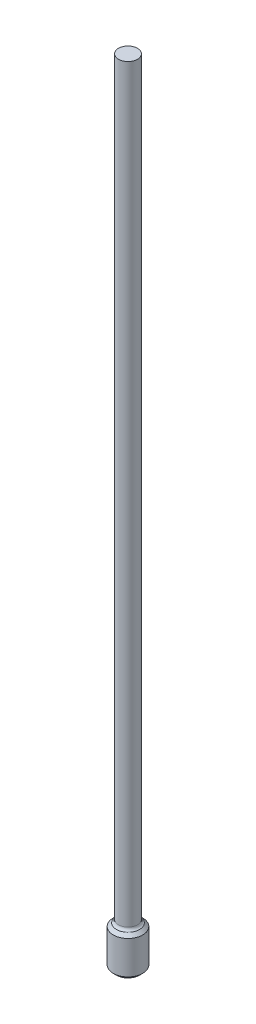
ISO-10303-21;
HEADER;
FILE_DESCRIPTION(('STEP AP214'),'2;1');
FILE_NAME('part.step','',(''),(''),'','','');
FILE_SCHEMA(('AUTOMOTIVE_DESIGN { 1 0 10303 214 1 1 1 1 }'));
ENDSEC;
DATA;
#1=APPLICATION_CONTEXT('core data for automotive mechanical design processes');
#2=APPLICATION_PROTOCOL_DEFINITION('international standard','automotive_design',2000,#1);
#3=PRODUCT_CONTEXT('',#1,'mechanical');
#4=PRODUCT('Part','Part','',(#3));
#5=PRODUCT_RELATED_PRODUCT_CATEGORY('part','',(#4));
#6=PRODUCT_DEFINITION_FORMATION('','',#4);
#7=PRODUCT_DEFINITION_CONTEXT('part definition',#1,'design');
#8=PRODUCT_DEFINITION('design','',#6,#7);
#9=PRODUCT_DEFINITION_SHAPE('','',#8);
#10=(LENGTH_UNIT() NAMED_UNIT(*) SI_UNIT(.MILLI.,.METRE.));
#11=(NAMED_UNIT(*) PLANE_ANGLE_UNIT() SI_UNIT($,.RADIAN.));
#12=(NAMED_UNIT(*) SI_UNIT($,.STERADIAN.) SOLID_ANGLE_UNIT());
#13=UNCERTAINTY_MEASURE_WITH_UNIT(LENGTH_MEASURE(1.E-05),#10,'distance_accuracy_value','');
#14=(GEOMETRIC_REPRESENTATION_CONTEXT(3) GLOBAL_UNCERTAINTY_ASSIGNED_CONTEXT((#13)) GLOBAL_UNIT_ASSIGNED_CONTEXT((#10,
#11,#12)) REPRESENTATION_CONTEXT('',''));
#15=CARTESIAN_POINT('',(0.,0.,0.));
#16=DIRECTION('',(0.,0.,1.));
#17=DIRECTION('',(1.,0.,0.));
#18=AXIS2_PLACEMENT_3D('',#15,#16,#17);
#19=CARTESIAN_POINT('',(0.,0.,0.));
#20=DIRECTION('',(0.,-1.,0.));
#21=DIRECTION('',(0.,0.,-1.));
#22=AXIS2_PLACEMENT_3D('',#19,#20,#21);
#23=PLANE('',#22);
#24=CARTESIAN_POINT('',(0.,0.,0.));
#25=DIRECTION('',(0.,-1.,0.));
#26=DIRECTION('',(0.,0.,-1.));
#27=AXIS2_PLACEMENT_3D('',#24,#25,#26);
#28=CIRCLE('',#27,0.927099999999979);
#29=CARTESIAN_POINT('',(0.,0.,-0.927099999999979));
#30=VERTEX_POINT('',#29);
#31=EDGE_CURVE('E37',#30,#30,#28,.T.);
#32=ORIENTED_EDGE('',*,*,#31,.T.);
#33=EDGE_LOOP('',(#32));
#34=FACE_BOUND('',#33,.T.);
#35=ADVANCED_FACE('F30',(#34),#23,.T.);
#36=CARTESIAN_POINT('',(0.,259.958771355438,0.));
#37=DIRECTION('',(0.,1.,0.));
#38=DIRECTION('',(0.,0.,1.));
#39=AXIS2_PLACEMENT_3D('',#36,#37,#38);
#40=CYLINDRICAL_SURFACE('',#39,1.18109999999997);
#41=CARTESIAN_POINT('',(0.,2.92100000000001,0.));
#42=DIRECTION('',(0.,1.,0.));
#43=DIRECTION('',(0.,0.,1.));
#44=AXIS2_PLACEMENT_3D('',#41,#42,#43);
#45=CIRCLE('',#44,1.18109999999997);
#46=CARTESIAN_POINT('',(0.,2.92100000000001,1.18109999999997));
#47=VERTEX_POINT('',#46);
#48=EDGE_CURVE('E41',#47,#47,#45,.F.);
#49=ORIENTED_EDGE('',*,*,#48,.T.);
#50=EDGE_LOOP('',(#49));
#51=FACE_BOUND('',#50,.T.);
#52=CARTESIAN_POINT('',(0.,0.253999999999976,0.));
#53=DIRECTION('',(0.,-1.,0.));
#54=DIRECTION('',(0.,0.,-1.));
#55=AXIS2_PLACEMENT_3D('',#52,#53,#54);
#56=CIRCLE('',#55,1.18109999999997);
#57=CARTESIAN_POINT('',(0.,0.253999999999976,-1.18109999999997));
#58=VERTEX_POINT('',#57);
#59=EDGE_CURVE('E45',#58,#58,#56,.F.);
#60=ORIENTED_EDGE('',*,*,#59,.T.);
#61=EDGE_LOOP('',(#60));
#62=FACE_BOUND('',#61,.T.);
#63=ADVANCED_FACE('F61',(#51,#62),#40,.T.);
#64=CARTESIAN_POINT('',(0.,259.958771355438,0.));
#65=DIRECTION('',(0.,1.,0.));
#66=DIRECTION('',(0.,0.,1.));
#67=AXIS2_PLACEMENT_3D('',#64,#65,#66);
#68=CYLINDRICAL_SURFACE('',#67,0.761999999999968);
#69=CARTESIAN_POINT('',(0.,3.41293442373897,0.));
#70=DIRECTION('',(0.,-1.,0.));
#71=DIRECTION('',(0.,0.,-1.));
#72=AXIS2_PLACEMENT_3D('',#69,#70,#71);
#73=CIRCLE('',#72,0.761999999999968);
#74=CARTESIAN_POINT('',(0.,3.41293442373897,-0.761999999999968));
#75=VERTEX_POINT('',#74);
#76=EDGE_CURVE('E10',#75,#75,#73,.F.);
#77=ORIENTED_EDGE('',*,*,#76,.T.);
#78=EDGE_LOOP('',(#77));
#79=FACE_BOUND('',#78,.T.);
#80=CARTESIAN_POINT('',(0.,63.5,0.));
#81=DIRECTION('',(0.,1.,0.));
#82=DIRECTION('',(0.,0.,1.));
#83=AXIS2_PLACEMENT_3D('',#80,#81,#82);
#84=CIRCLE('',#83,0.761999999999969);
#85=CARTESIAN_POINT('',(0.,63.5,0.761999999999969));
#86=VERTEX_POINT('',#85);
#87=EDGE_CURVE('E53',#86,#86,#84,.T.);
#88=ORIENTED_EDGE('',*,*,#87,.F.);
#89=EDGE_LOOP('',(#88));
#90=FACE_BOUND('',#89,.T.);
#91=ADVANCED_FACE('F59',(#79,#90),#68,.T.);
#92=CARTESIAN_POINT('',(-0.761999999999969,63.5,0.));
#93=DIRECTION('',(0.,1.,0.));
#94=DIRECTION('',(0.,0.,1.));
#95=AXIS2_PLACEMENT_3D('',#92,#93,#94);
#96=PLANE('',#95);
#97=ORIENTED_EDGE('',*,*,#87,.T.);
#98=EDGE_LOOP('',(#97));
#99=FACE_BOUND('',#98,.T.);
#100=ADVANCED_FACE('F57',(#99),#96,.T.);
#101=CARTESIAN_POINT('',(0.,3.17499999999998,0.));
#102=DIRECTION('',(0.,-1.,0.));
#103=DIRECTION('',(0.,0.,-1.));
#104=AXIS2_PLACEMENT_3D('',#101,#102,#103);
#105=CONICAL_SURFACE('',#104,0.927099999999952,0.785398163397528);
#106=ORIENTED_EDGE('',*,*,#48,.F.);
#107=EDGE_LOOP('',(#106));
#108=FACE_BOUND('',#107,.T.);
#109=CARTESIAN_POINT('',(0.,3.175,0.));
#110=DIRECTION('',(0.,1.,0.));
#111=DIRECTION('',(0.,0.,1.));
#112=AXIS2_PLACEMENT_3D('',#109,#110,#111);
#113=CIRCLE('',#112,0.927099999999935);
#114=CARTESIAN_POINT('',(0.,3.175,0.927099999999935));
#115=VERTEX_POINT('',#114);
#116=EDGE_CURVE('E50',#115,#115,#113,.T.);
#117=ORIENTED_EDGE('',*,*,#116,.F.);
#118=EDGE_LOOP('',(#117));
#119=FACE_BOUND('',#118,.T.);
#120=ADVANCED_FACE('F67',(#108,#119),#105,.T.);
#121=CARTESIAN_POINT('',(0.,0.253999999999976,0.));
#122=DIRECTION('',(0.,1.,0.));
#123=DIRECTION('',(0.,0.,1.));
#124=AXIS2_PLACEMENT_3D('',#121,#122,#123);
#125=CONICAL_SURFACE('',#124,1.18109999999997,0.785398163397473);
#126=ORIENTED_EDGE('',*,*,#31,.F.);
#127=EDGE_LOOP('',(#126));
#128=FACE_BOUND('',#127,.T.);
#129=ORIENTED_EDGE('',*,*,#59,.F.);
#130=EDGE_LOOP('',(#129));
#131=FACE_BOUND('',#130,.T.);
#132=ADVANCED_FACE('F77',(#128,#131),#125,.T.);
#133=CARTESIAN_POINT('',(0.,3.41293442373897,0.));
#134=DIRECTION('',(0.,-1.,0.));
#135=DIRECTION('',(0.,0.,-1.));
#136=AXIS2_PLACEMENT_3D('',#133,#134,#135);
#137=TOROIDAL_SURFACE('',#136,1.01599999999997,0.254);
#138=ORIENTED_EDGE('',*,*,#116,.T.);
#139=EDGE_LOOP('',(#138));
#140=FACE_BOUND('',#139,.T.);
#141=ORIENTED_EDGE('',*,*,#76,.F.);
#142=EDGE_LOOP('',(#141));
#143=FACE_BOUND('',#142,.T.);
#144=ADVANCED_FACE('F32',(#140,#143),#137,.F.);
#145=CLOSED_SHELL('',(#35,#63,#91,#100,#120,#132,#144));
#146=MANIFOLD_SOLID_BREP('B2',#145);
#147=ADVANCED_BREP_SHAPE_REPRESENTATION('',(#18,#146),#14);
#148=SHAPE_DEFINITION_REPRESENTATION(#9,#147);
ENDSEC;
END-ISO-10303-21;
